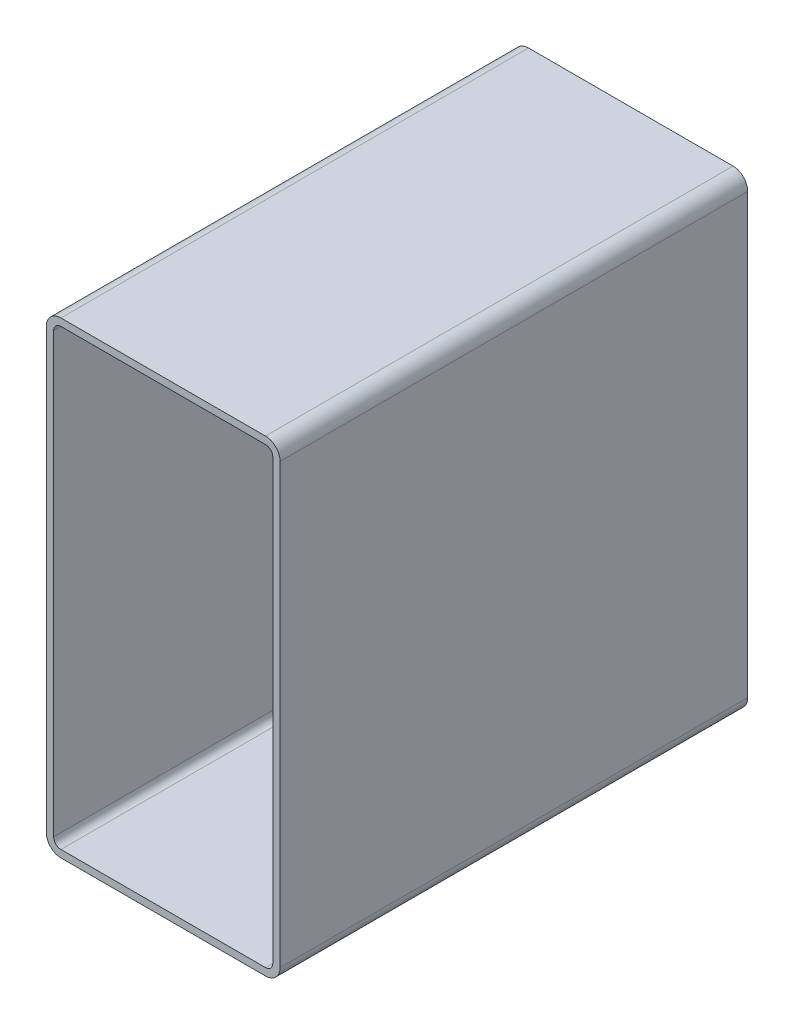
ISO-10303-21;
HEADER;
FILE_DESCRIPTION(('STEP AP214'),'2;1');
FILE_NAME('part.step','',(''),(''),'','','');
FILE_SCHEMA(('AUTOMOTIVE_DESIGN { 1 0 10303 214 1 1 1 1 }'));
ENDSEC;
DATA;
#1=APPLICATION_CONTEXT('core data for automotive mechanical design processes');
#2=APPLICATION_PROTOCOL_DEFINITION('international standard','automotive_design',2000,#1);
#3=PRODUCT_CONTEXT('',#1,'mechanical');
#4=PRODUCT('Part','Part','',(#3));
#5=PRODUCT_RELATED_PRODUCT_CATEGORY('part','',(#4));
#6=PRODUCT_DEFINITION_FORMATION('','',#4);
#7=PRODUCT_DEFINITION_CONTEXT('part definition',#1,'design');
#8=PRODUCT_DEFINITION('design','',#6,#7);
#9=PRODUCT_DEFINITION_SHAPE('','',#8);
#10=(LENGTH_UNIT() NAMED_UNIT(*) SI_UNIT(.MILLI.,.METRE.));
#11=(NAMED_UNIT(*) PLANE_ANGLE_UNIT() SI_UNIT($,.RADIAN.));
#12=(NAMED_UNIT(*) SI_UNIT($,.STERADIAN.) SOLID_ANGLE_UNIT());
#13=UNCERTAINTY_MEASURE_WITH_UNIT(LENGTH_MEASURE(1.E-05),#10,'distance_accuracy_value','');
#14=(GEOMETRIC_REPRESENTATION_CONTEXT(3) GLOBAL_UNCERTAINTY_ASSIGNED_CONTEXT((#13)) GLOBAL_UNIT_ASSIGNED_CONTEXT((#10,
#11,#12)) REPRESENTATION_CONTEXT('',''));
#15=CARTESIAN_POINT('',(0.,0.,0.));
#16=DIRECTION('',(0.,0.,1.));
#17=DIRECTION('',(1.,0.,0.));
#18=AXIS2_PLACEMENT_3D('',#15,#16,#17);
#19=CARTESIAN_POINT('',(9.57230139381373,297.149496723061,304.8));
#20=DIRECTION('',(0.,0.,1.));
#21=DIRECTION('',(1.,0.,0.));
#22=AXIS2_PLACEMENT_3D('',#19,#20,#21);
#23=PLANE('',#22);
#24=CARTESIAN_POINT('',(9.57230139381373,297.149496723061,304.8));
#25=DIRECTION('',(0.,0.,1.));
#26=DIRECTION('',(1.,0.,0.));
#27=AXIS2_PLACEMENT_3D('',#24,#25,#26);
#28=CIRCLE('',#27,9.52500000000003);
#29=CARTESIAN_POINT('',(9.57230139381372,306.674496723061,304.8));
#30=VERTEX_POINT('',#29);
#31=CARTESIAN_POINT('',(0.0473013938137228,297.149496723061,304.8));
#32=VERTEX_POINT('',#31);
#33=EDGE_CURVE('E211',#30,#32,#28,.T.);
#34=ORIENTED_EDGE('',*,*,#33,.T.);
#35=DIRECTION('',(0.,-1.,0.));
#36=VECTOR('',#35,1.);
#37=CARTESIAN_POINT('',(0.0473013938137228,11.3994967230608,304.8));
#38=LINE('',#37,#36);
#39=CARTESIAN_POINT('',(0.0473013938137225,11.3994967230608,304.8));
#40=VERTEX_POINT('',#39);
#41=EDGE_CURVE('E214',#32,#40,#38,.T.);
#42=ORIENTED_EDGE('',*,*,#41,.T.);
#43=CARTESIAN_POINT('',(9.57230139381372,11.3994967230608,304.8));
#44=DIRECTION('',(0.,0.,1.));
#45=DIRECTION('',(1.,0.,0.));
#46=AXIS2_PLACEMENT_3D('',#43,#44,#45);
#47=CIRCLE('',#46,9.525);
#48=CARTESIAN_POINT('',(9.57230139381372,1.87449672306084,304.8));
#49=VERTEX_POINT('',#48);
#50=EDGE_CURVE('E217',#40,#49,#47,.T.);
#51=ORIENTED_EDGE('',*,*,#50,.T.);
#52=DIRECTION('',(1.,0.,0.));
#53=VECTOR('',#52,1.);
#54=CARTESIAN_POINT('',(142.922301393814,1.87449672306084,304.8));
#55=LINE('',#54,#53);
#56=CARTESIAN_POINT('',(142.922301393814,1.87449672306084,304.8));
#57=VERTEX_POINT('',#56);
#58=EDGE_CURVE('E219',#49,#57,#55,.T.);
#59=ORIENTED_EDGE('',*,*,#58,.T.);
#60=CARTESIAN_POINT('',(142.922301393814,11.3994967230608,304.8));
#61=DIRECTION('',(0.,0.,1.));
#62=DIRECTION('',(1.,0.,0.));
#63=AXIS2_PLACEMENT_3D('',#60,#61,#62);
#64=CIRCLE('',#63,9.52500000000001);
#65=CARTESIAN_POINT('',(152.447301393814,11.3994967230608,304.8));
#66=VERTEX_POINT('',#65);
#67=EDGE_CURVE('E221',#57,#66,#64,.T.);
#68=ORIENTED_EDGE('',*,*,#67,.T.);
#69=DIRECTION('',(0.,1.,0.));
#70=VECTOR('',#69,1.);
#71=CARTESIAN_POINT('',(152.447301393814,297.149496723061,304.8));
#72=LINE('',#71,#70);
#73=CARTESIAN_POINT('',(152.447301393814,297.149496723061,304.8));
#74=VERTEX_POINT('',#73);
#75=EDGE_CURVE('E223',#66,#74,#72,.T.);
#76=ORIENTED_EDGE('',*,*,#75,.T.);
#77=CARTESIAN_POINT('',(142.922301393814,297.149496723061,304.8));
#78=DIRECTION('',(0.,0.,1.));
#79=DIRECTION('',(1.,0.,0.));
#80=AXIS2_PLACEMENT_3D('',#77,#78,#79);
#81=CIRCLE('',#80,9.52500000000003);
#82=CARTESIAN_POINT('',(142.922301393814,306.674496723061,304.8));
#83=VERTEX_POINT('',#82);
#84=EDGE_CURVE('E225',#74,#83,#81,.T.);
#85=ORIENTED_EDGE('',*,*,#84,.T.);
#86=DIRECTION('',(-1.,0.,0.));
#87=VECTOR('',#86,1.);
#88=CARTESIAN_POINT('',(9.57230139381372,306.674496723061,304.8));
#89=LINE('',#88,#87);
#90=EDGE_CURVE('E227',#83,#30,#89,.T.);
#91=ORIENTED_EDGE('',*,*,#90,.T.);
#92=EDGE_LOOP('',(#34,#42,#51,#59,#68,#76,#85,#91));
#93=FACE_BOUND('',#92,.T.);
#94=DIRECTION('',(0.,-1.,0.));
#95=VECTOR('',#94,1.);
#96=CARTESIAN_POINT('',(4.80980139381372,11.3994967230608,304.8));
#97=LINE('',#96,#95);
#98=CARTESIAN_POINT('',(4.80980139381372,297.149496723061,304.8));
#99=VERTEX_POINT('',#98);
#100=CARTESIAN_POINT('',(4.80980139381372,11.3994967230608,304.8));
#101=VERTEX_POINT('',#100);
#102=EDGE_CURVE('E154',#99,#101,#97,.T.);
#103=ORIENTED_EDGE('',*,*,#102,.F.);
#104=CARTESIAN_POINT('',(9.57230139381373,297.149496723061,304.8));
#105=DIRECTION('',(0.,0.,1.));
#106=DIRECTION('',(1.,0.,0.));
#107=AXIS2_PLACEMENT_3D('',#104,#105,#106);
#108=CIRCLE('',#107,4.7625);
#109=CARTESIAN_POINT('',(9.57230139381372,301.911996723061,304.8));
#110=VERTEX_POINT('',#109);
#111=EDGE_CURVE('E146',#110,#99,#108,.T.);
#112=ORIENTED_EDGE('',*,*,#111,.F.);
#113=DIRECTION('',(-1.,0.,0.));
#114=VECTOR('',#113,1.);
#115=CARTESIAN_POINT('',(9.57230139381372,301.911996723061,304.8));
#116=LINE('',#115,#114);
#117=CARTESIAN_POINT('',(142.922301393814,301.911996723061,304.8));
#118=VERTEX_POINT('',#117);
#119=EDGE_CURVE('E179',#118,#110,#116,.T.);
#120=ORIENTED_EDGE('',*,*,#119,.F.);
#121=CARTESIAN_POINT('',(142.922301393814,297.149496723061,304.8));
#122=DIRECTION('',(0.,0.,1.));
#123=DIRECTION('',(1.,0.,0.));
#124=AXIS2_PLACEMENT_3D('',#121,#122,#123);
#125=CIRCLE('',#124,4.7625);
#126=CARTESIAN_POINT('',(147.684801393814,297.149496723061,304.8));
#127=VERTEX_POINT('',#126);
#128=EDGE_CURVE('E177',#127,#118,#125,.T.);
#129=ORIENTED_EDGE('',*,*,#128,.F.);
#130=DIRECTION('',(0.,1.,0.));
#131=VECTOR('',#130,1.);
#132=CARTESIAN_POINT('',(147.684801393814,297.149496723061,304.8));
#133=LINE('',#132,#131);
#134=CARTESIAN_POINT('',(147.684801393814,11.3994967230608,304.8));
#135=VERTEX_POINT('',#134);
#136=EDGE_CURVE('E175',#135,#127,#133,.T.);
#137=ORIENTED_EDGE('',*,*,#136,.F.);
#138=CARTESIAN_POINT('',(142.922301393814,11.3994967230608,304.8));
#139=DIRECTION('',(0.,0.,1.));
#140=DIRECTION('',(1.,0.,0.));
#141=AXIS2_PLACEMENT_3D('',#138,#139,#140);
#142=CIRCLE('',#141,4.7625);
#143=CARTESIAN_POINT('',(142.922301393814,6.63699672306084,304.8));
#144=VERTEX_POINT('',#143);
#145=EDGE_CURVE('E173',#144,#135,#142,.T.);
#146=ORIENTED_EDGE('',*,*,#145,.F.);
#147=DIRECTION('',(1.,0.,0.));
#148=VECTOR('',#147,1.);
#149=CARTESIAN_POINT('',(142.922301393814,6.63699672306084,304.8));
#150=LINE('',#149,#148);
#151=CARTESIAN_POINT('',(9.57230139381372,6.63699672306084,304.8));
#152=VERTEX_POINT('',#151);
#153=EDGE_CURVE('E169',#152,#144,#150,.T.);
#154=ORIENTED_EDGE('',*,*,#153,.F.);
#155=CARTESIAN_POINT('',(9.57230139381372,11.3994967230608,304.8));
#156=DIRECTION('',(0.,0.,1.));
#157=DIRECTION('',(1.,0.,0.));
#158=AXIS2_PLACEMENT_3D('',#155,#156,#157);
#159=CIRCLE('',#158,4.7625);
#160=EDGE_CURVE('E167',#101,#152,#159,.T.);
#161=ORIENTED_EDGE('',*,*,#160,.F.);
#162=EDGE_LOOP('',(#103,#112,#120,#129,#137,#146,#154,#161));
#163=FACE_BOUND('',#162,.T.);
#164=ADVANCED_FACE('F33',(#93,#163),#23,.T.);
#165=CARTESIAN_POINT('',(9.57230139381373,297.149496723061,0.));
#166=DIRECTION('',(0.,0.,1.));
#167=DIRECTION('',(1.,0.,0.));
#168=AXIS2_PLACEMENT_3D('',#165,#166,#167);
#169=PLANE('',#168);
#170=CARTESIAN_POINT('',(9.57230139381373,297.149496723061,0.));
#171=DIRECTION('',(0.,0.,1.));
#172=DIRECTION('',(1.,0.,0.));
#173=AXIS2_PLACEMENT_3D('',#170,#171,#172);
#174=CIRCLE('',#173,9.52500000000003);
#175=CARTESIAN_POINT('',(9.57230139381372,306.674496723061,0.));
#176=VERTEX_POINT('',#175);
#177=CARTESIAN_POINT('',(0.0473013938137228,297.149496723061,0.));
#178=VERTEX_POINT('',#177);
#179=EDGE_CURVE('E162',#176,#178,#174,.T.);
#180=ORIENTED_EDGE('',*,*,#179,.F.);
#181=DIRECTION('',(-1.,0.,0.));
#182=VECTOR('',#181,1.);
#183=CARTESIAN_POINT('',(9.57230139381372,306.674496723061,0.));
#184=LINE('',#183,#182);
#185=CARTESIAN_POINT('',(142.922301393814,306.674496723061,0.));
#186=VERTEX_POINT('',#185);
#187=EDGE_CURVE('E215',#186,#176,#184,.T.);
#188=ORIENTED_EDGE('',*,*,#187,.F.);
#189=CARTESIAN_POINT('',(142.922301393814,297.149496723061,0.));
#190=DIRECTION('',(0.,0.,1.));
#191=DIRECTION('',(1.,0.,0.));
#192=AXIS2_PLACEMENT_3D('',#189,#190,#191);
#193=CIRCLE('',#192,9.52500000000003);
#194=CARTESIAN_POINT('',(152.447301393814,297.149496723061,0.));
#195=VERTEX_POINT('',#194);
#196=EDGE_CURVE('E242',#195,#186,#193,.T.);
#197=ORIENTED_EDGE('',*,*,#196,.F.);
#198=DIRECTION('',(0.,1.,0.));
#199=VECTOR('',#198,1.);
#200=CARTESIAN_POINT('',(152.447301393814,297.149496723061,0.));
#201=LINE('',#200,#199);
#202=CARTESIAN_POINT('',(152.447301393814,11.3994967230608,0.));
#203=VERTEX_POINT('',#202);
#204=EDGE_CURVE('E240',#203,#195,#201,.T.);
#205=ORIENTED_EDGE('',*,*,#204,.F.);
#206=CARTESIAN_POINT('',(142.922301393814,11.3994967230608,0.));
#207=DIRECTION('',(0.,0.,1.));
#208=DIRECTION('',(1.,0.,0.));
#209=AXIS2_PLACEMENT_3D('',#206,#207,#208);
#210=CIRCLE('',#209,9.52500000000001);
#211=CARTESIAN_POINT('',(142.922301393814,1.87449672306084,0.));
#212=VERTEX_POINT('',#211);
#213=EDGE_CURVE('E238',#212,#203,#210,.T.);
#214=ORIENTED_EDGE('',*,*,#213,.F.);
#215=DIRECTION('',(1.,0.,0.));
#216=VECTOR('',#215,1.);
#217=CARTESIAN_POINT('',(142.922301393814,1.87449672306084,0.));
#218=LINE('',#217,#216);
#219=CARTESIAN_POINT('',(9.57230139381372,1.87449672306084,0.));
#220=VERTEX_POINT('',#219);
#221=EDGE_CURVE('E236',#220,#212,#218,.T.);
#222=ORIENTED_EDGE('',*,*,#221,.F.);
#223=CARTESIAN_POINT('',(9.57230139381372,11.3994967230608,0.));
#224=DIRECTION('',(0.,0.,1.));
#225=DIRECTION('',(1.,0.,0.));
#226=AXIS2_PLACEMENT_3D('',#223,#224,#225);
#227=CIRCLE('',#226,9.525);
#228=CARTESIAN_POINT('',(0.0473013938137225,11.3994967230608,0.));
#229=VERTEX_POINT('',#228);
#230=EDGE_CURVE('E234',#229,#220,#227,.T.);
#231=ORIENTED_EDGE('',*,*,#230,.F.);
#232=DIRECTION('',(0.,-1.,0.));
#233=VECTOR('',#232,1.);
#234=CARTESIAN_POINT('',(0.0473013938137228,11.3994967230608,0.));
#235=LINE('',#234,#233);
#236=EDGE_CURVE('E232',#178,#229,#235,.T.);
#237=ORIENTED_EDGE('',*,*,#236,.F.);
#238=EDGE_LOOP('',(#180,#188,#197,#205,#214,#222,#231,#237));
#239=FACE_BOUND('',#238,.T.);
#240=CARTESIAN_POINT('',(9.57230139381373,297.149496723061,0.));
#241=DIRECTION('',(0.,0.,1.));
#242=DIRECTION('',(1.,0.,0.));
#243=AXIS2_PLACEMENT_3D('',#240,#241,#242);
#244=CIRCLE('',#243,4.7625);
#245=CARTESIAN_POINT('',(9.57230139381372,301.911996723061,0.));
#246=VERTEX_POINT('',#245);
#247=CARTESIAN_POINT('',(4.80980139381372,297.149496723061,0.));
#248=VERTEX_POINT('',#247);
#249=EDGE_CURVE('E56',#246,#248,#244,.T.);
#250=ORIENTED_EDGE('',*,*,#249,.T.);
#251=DIRECTION('',(0.,-1.,0.));
#252=VECTOR('',#251,1.);
#253=CARTESIAN_POINT('',(4.80980139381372,11.3994967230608,0.));
#254=LINE('',#253,#252);
#255=CARTESIAN_POINT('',(4.80980139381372,11.3994967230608,0.));
#256=VERTEX_POINT('',#255);
#257=EDGE_CURVE('E161',#248,#256,#254,.T.);
#258=ORIENTED_EDGE('',*,*,#257,.T.);
#259=CARTESIAN_POINT('',(9.57230139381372,11.3994967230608,0.));
#260=DIRECTION('',(0.,0.,1.));
#261=DIRECTION('',(1.,0.,0.));
#262=AXIS2_PLACEMENT_3D('',#259,#260,#261);
#263=CIRCLE('',#262,4.7625);
#264=CARTESIAN_POINT('',(9.57230139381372,6.63699672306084,0.));
#265=VERTEX_POINT('',#264);
#266=EDGE_CURVE('E183',#256,#265,#263,.T.);
#267=ORIENTED_EDGE('',*,*,#266,.T.);
#268=DIRECTION('',(1.,0.,0.));
#269=VECTOR('',#268,1.);
#270=CARTESIAN_POINT('',(142.922301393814,6.63699672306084,0.));
#271=LINE('',#270,#269);
#272=CARTESIAN_POINT('',(142.922301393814,6.63699672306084,0.));
#273=VERTEX_POINT('',#272);
#274=EDGE_CURVE('E186',#265,#273,#271,.T.);
#275=ORIENTED_EDGE('',*,*,#274,.T.);
#276=CARTESIAN_POINT('',(142.922301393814,11.3994967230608,0.));
#277=DIRECTION('',(0.,0.,1.));
#278=DIRECTION('',(1.,0.,0.));
#279=AXIS2_PLACEMENT_3D('',#276,#277,#278);
#280=CIRCLE('',#279,4.7625);
#281=CARTESIAN_POINT('',(147.684801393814,11.3994967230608,0.));
#282=VERTEX_POINT('',#281);
#283=EDGE_CURVE('E189',#273,#282,#280,.T.);
#284=ORIENTED_EDGE('',*,*,#283,.T.);
#285=DIRECTION('',(0.,1.,0.));
#286=VECTOR('',#285,1.);
#287=CARTESIAN_POINT('',(147.684801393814,297.149496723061,0.));
#288=LINE('',#287,#286);
#289=CARTESIAN_POINT('',(147.684801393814,297.149496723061,0.));
#290=VERTEX_POINT('',#289);
#291=EDGE_CURVE('E192',#282,#290,#288,.T.);
#292=ORIENTED_EDGE('',*,*,#291,.T.);
#293=CARTESIAN_POINT('',(142.922301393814,297.149496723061,0.));
#294=DIRECTION('',(0.,0.,1.));
#295=DIRECTION('',(1.,0.,0.));
#296=AXIS2_PLACEMENT_3D('',#293,#294,#295);
#297=CIRCLE('',#296,4.7625);
#298=CARTESIAN_POINT('',(142.922301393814,301.911996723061,0.));
#299=VERTEX_POINT('',#298);
#300=EDGE_CURVE('E195',#290,#299,#297,.T.);
#301=ORIENTED_EDGE('',*,*,#300,.T.);
#302=DIRECTION('',(-1.,0.,0.));
#303=VECTOR('',#302,1.);
#304=CARTESIAN_POINT('',(9.57230139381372,301.911996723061,0.));
#305=LINE('',#304,#303);
#306=EDGE_CURVE('E155',#299,#246,#305,.T.);
#307=ORIENTED_EDGE('',*,*,#306,.T.);
#308=EDGE_LOOP('',(#250,#258,#267,#275,#284,#292,#301,#307));
#309=FACE_BOUND('',#308,.T.);
#310=ADVANCED_FACE('F272',(#239,#309),#169,.F.);
#311=CARTESIAN_POINT('',(9.57230139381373,297.149496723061,304.8));
#312=DIRECTION('',(0.,0.,-1.));
#313=DIRECTION('',(-1.,0.,0.));
#314=AXIS2_PLACEMENT_3D('',#311,#312,#313);
#315=CYLINDRICAL_SURFACE('',#314,9.52500000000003);
#316=ORIENTED_EDGE('',*,*,#179,.T.);
#317=DIRECTION('',(0.,0.,-1.));
#318=VECTOR('',#317,1.);
#319=CARTESIAN_POINT('',(0.0473013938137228,297.149496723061,304.8));
#320=LINE('',#319,#318);
#321=EDGE_CURVE('E11',#32,#178,#320,.T.);
#322=ORIENTED_EDGE('',*,*,#321,.F.);
#323=ORIENTED_EDGE('',*,*,#33,.F.);
#324=DIRECTION('',(0.,0.,-1.));
#325=VECTOR('',#324,1.);
#326=CARTESIAN_POINT('',(9.57230139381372,306.674496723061,304.8));
#327=LINE('',#326,#325);
#328=EDGE_CURVE('E229',#30,#176,#327,.T.);
#329=ORIENTED_EDGE('',*,*,#328,.T.);
#330=EDGE_LOOP('',(#316,#322,#323,#329));
#331=FACE_BOUND('',#330,.T.);
#332=ADVANCED_FACE('F35',(#331),#315,.T.);
#333=CARTESIAN_POINT('',(0.0473013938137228,11.3994967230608,304.8));
#334=DIRECTION('',(1.,0.,0.));
#335=DIRECTION('',(0.,0.,-1.));
#336=AXIS2_PLACEMENT_3D('',#333,#334,#335);
#337=PLANE('',#336);
#338=ORIENTED_EDGE('',*,*,#236,.T.);
#339=DIRECTION('',(0.,0.,-1.));
#340=VECTOR('',#339,1.);
#341=CARTESIAN_POINT('',(0.0473013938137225,11.3994967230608,304.8));
#342=LINE('',#341,#340);
#343=EDGE_CURVE('E41',#40,#229,#342,.T.);
#344=ORIENTED_EDGE('',*,*,#343,.F.);
#345=ORIENTED_EDGE('',*,*,#41,.F.);
#346=ORIENTED_EDGE('',*,*,#321,.T.);
#347=EDGE_LOOP('',(#338,#344,#345,#346));
#348=FACE_BOUND('',#347,.T.);
#349=ADVANCED_FACE('F289',(#348),#337,.F.);
#350=CARTESIAN_POINT('',(9.57230139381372,11.3994967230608,304.8));
#351=DIRECTION('',(0.,0.,-1.));
#352=DIRECTION('',(-1.,0.,0.));
#353=AXIS2_PLACEMENT_3D('',#350,#351,#352);
#354=CYLINDRICAL_SURFACE('',#353,9.525);
#355=ORIENTED_EDGE('',*,*,#230,.T.);
#356=DIRECTION('',(0.,0.,-1.));
#357=VECTOR('',#356,1.);
#358=CARTESIAN_POINT('',(9.57230139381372,1.87449672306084,304.8));
#359=LINE('',#358,#357);
#360=EDGE_CURVE('E259',#49,#220,#359,.T.);
#361=ORIENTED_EDGE('',*,*,#360,.F.);
#362=ORIENTED_EDGE('',*,*,#50,.F.);
#363=ORIENTED_EDGE('',*,*,#343,.T.);
#364=EDGE_LOOP('',(#355,#361,#362,#363));
#365=FACE_BOUND('',#364,.T.);
#366=ADVANCED_FACE('F266',(#365),#354,.T.);
#367=CARTESIAN_POINT('',(142.922301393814,1.87449672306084,304.8));
#368=DIRECTION('',(0.,1.,0.));
#369=DIRECTION('',(0.,0.,1.));
#370=AXIS2_PLACEMENT_3D('',#367,#368,#369);
#371=PLANE('',#370);
#372=ORIENTED_EDGE('',*,*,#221,.T.);
#373=DIRECTION('',(0.,0.,-1.));
#374=VECTOR('',#373,1.);
#375=CARTESIAN_POINT('',(142.922301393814,1.87449672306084,304.8));
#376=LINE('',#375,#374);
#377=EDGE_CURVE('E256',#57,#212,#376,.T.);
#378=ORIENTED_EDGE('',*,*,#377,.F.);
#379=ORIENTED_EDGE('',*,*,#58,.F.);
#380=ORIENTED_EDGE('',*,*,#360,.T.);
#381=EDGE_LOOP('',(#372,#378,#379,#380));
#382=FACE_BOUND('',#381,.T.);
#383=ADVANCED_FACE('F278',(#382),#371,.F.);
#384=CARTESIAN_POINT('',(142.922301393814,11.3994967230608,304.8));
#385=DIRECTION('',(0.,0.,-1.));
#386=DIRECTION('',(-1.,0.,0.));
#387=AXIS2_PLACEMENT_3D('',#384,#385,#386);
#388=CYLINDRICAL_SURFACE('',#387,9.52500000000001);
#389=ORIENTED_EDGE('',*,*,#213,.T.);
#390=DIRECTION('',(0.,0.,-1.));
#391=VECTOR('',#390,1.);
#392=CARTESIAN_POINT('',(152.447301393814,11.3994967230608,304.8));
#393=LINE('',#392,#391);
#394=EDGE_CURVE('E253',#66,#203,#393,.T.);
#395=ORIENTED_EDGE('',*,*,#394,.F.);
#396=ORIENTED_EDGE('',*,*,#67,.F.);
#397=ORIENTED_EDGE('',*,*,#377,.T.);
#398=EDGE_LOOP('',(#389,#395,#396,#397));
#399=FACE_BOUND('',#398,.T.);
#400=ADVANCED_FACE('F282',(#399),#388,.T.);
#401=CARTESIAN_POINT('',(152.447301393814,297.149496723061,304.8));
#402=DIRECTION('',(-1.,0.,0.));
#403=DIRECTION('',(0.,0.,1.));
#404=AXIS2_PLACEMENT_3D('',#401,#402,#403);
#405=PLANE('',#404);
#406=ORIENTED_EDGE('',*,*,#204,.T.);
#407=DIRECTION('',(0.,0.,-1.));
#408=VECTOR('',#407,1.);
#409=CARTESIAN_POINT('',(152.447301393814,297.149496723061,304.8));
#410=LINE('',#409,#408);
#411=EDGE_CURVE('E250',#74,#195,#410,.T.);
#412=ORIENTED_EDGE('',*,*,#411,.F.);
#413=ORIENTED_EDGE('',*,*,#75,.F.);
#414=ORIENTED_EDGE('',*,*,#394,.T.);
#415=EDGE_LOOP('',(#406,#412,#413,#414));
#416=FACE_BOUND('',#415,.T.);
#417=ADVANCED_FACE('F302',(#416),#405,.F.);
#418=CARTESIAN_POINT('',(142.922301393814,297.149496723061,304.8));
#419=DIRECTION('',(0.,0.,-1.));
#420=DIRECTION('',(-1.,0.,0.));
#421=AXIS2_PLACEMENT_3D('',#418,#419,#420);
#422=CYLINDRICAL_SURFACE('',#421,9.52500000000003);
#423=ORIENTED_EDGE('',*,*,#196,.T.);
#424=DIRECTION('',(0.,0.,-1.));
#425=VECTOR('',#424,1.);
#426=CARTESIAN_POINT('',(142.922301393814,306.674496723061,304.8));
#427=LINE('',#426,#425);
#428=EDGE_CURVE('E247',#83,#186,#427,.T.);
#429=ORIENTED_EDGE('',*,*,#428,.F.);
#430=ORIENTED_EDGE('',*,*,#84,.F.);
#431=ORIENTED_EDGE('',*,*,#411,.T.);
#432=EDGE_LOOP('',(#423,#429,#430,#431));
#433=FACE_BOUND('',#432,.T.);
#434=ADVANCED_FACE('F300',(#433),#422,.T.);
#435=CARTESIAN_POINT('',(9.57230139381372,306.674496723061,304.8));
#436=DIRECTION('',(0.,-1.,0.));
#437=DIRECTION('',(0.,0.,-1.));
#438=AXIS2_PLACEMENT_3D('',#435,#436,#437);
#439=PLANE('',#438);
#440=ORIENTED_EDGE('',*,*,#187,.T.);
#441=ORIENTED_EDGE('',*,*,#328,.F.);
#442=ORIENTED_EDGE('',*,*,#90,.F.);
#443=ORIENTED_EDGE('',*,*,#428,.T.);
#444=EDGE_LOOP('',(#440,#441,#442,#443));
#445=FACE_BOUND('',#444,.T.);
#446=ADVANCED_FACE('F295',(#445),#439,.F.);
#447=CARTESIAN_POINT('',(9.57230139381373,297.149496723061,304.8));
#448=DIRECTION('',(0.,0.,-1.));
#449=DIRECTION('',(-1.,0.,0.));
#450=AXIS2_PLACEMENT_3D('',#447,#448,#449);
#451=CYLINDRICAL_SURFACE('',#450,4.7625);
#452=ORIENTED_EDGE('',*,*,#249,.F.);
#453=DIRECTION('',(0.,0.,-1.));
#454=VECTOR('',#453,1.);
#455=CARTESIAN_POINT('',(9.57230139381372,301.911996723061,304.8));
#456=LINE('',#455,#454);
#457=EDGE_CURVE('E150',#110,#246,#456,.T.);
#458=ORIENTED_EDGE('',*,*,#457,.F.);
#459=ORIENTED_EDGE('',*,*,#111,.T.);
#460=DIRECTION('',(0.,0.,-1.));
#461=VECTOR('',#460,1.);
#462=CARTESIAN_POINT('',(4.80980139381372,297.149496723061,304.8));
#463=LINE('',#462,#461);
#464=EDGE_CURVE('E149',#99,#248,#463,.T.);
#465=ORIENTED_EDGE('',*,*,#464,.T.);
#466=EDGE_LOOP('',(#452,#458,#459,#465));
#467=FACE_BOUND('',#466,.T.);
#468=ADVANCED_FACE('F148',(#467),#451,.F.);
#469=CARTESIAN_POINT('',(4.80980139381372,11.3994967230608,304.8));
#470=DIRECTION('',(1.,0.,0.));
#471=DIRECTION('',(0.,0.,-1.));
#472=AXIS2_PLACEMENT_3D('',#469,#470,#471);
#473=PLANE('',#472);
#474=ORIENTED_EDGE('',*,*,#257,.F.);
#475=ORIENTED_EDGE('',*,*,#464,.F.);
#476=ORIENTED_EDGE('',*,*,#102,.T.);
#477=DIRECTION('',(0.,0.,-1.));
#478=VECTOR('',#477,1.);
#479=CARTESIAN_POINT('',(4.80980139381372,11.3994967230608,304.8));
#480=LINE('',#479,#478);
#481=EDGE_CURVE('E163',#101,#256,#480,.T.);
#482=ORIENTED_EDGE('',*,*,#481,.T.);
#483=EDGE_LOOP('',(#474,#475,#476,#482));
#484=FACE_BOUND('',#483,.T.);
#485=ADVANCED_FACE('F158',(#484),#473,.T.);
#486=CARTESIAN_POINT('',(9.57230139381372,11.3994967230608,304.8));
#487=DIRECTION('',(0.,0.,-1.));
#488=DIRECTION('',(-1.,0.,0.));
#489=AXIS2_PLACEMENT_3D('',#486,#487,#488);
#490=CYLINDRICAL_SURFACE('',#489,4.7625);
#491=ORIENTED_EDGE('',*,*,#266,.F.);
#492=ORIENTED_EDGE('',*,*,#481,.F.);
#493=ORIENTED_EDGE('',*,*,#160,.T.);
#494=DIRECTION('',(0.,0.,-1.));
#495=VECTOR('',#494,1.);
#496=CARTESIAN_POINT('',(9.57230139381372,6.63699672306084,304.8));
#497=LINE('',#496,#495);
#498=EDGE_CURVE('E208',#152,#265,#497,.T.);
#499=ORIENTED_EDGE('',*,*,#498,.T.);
#500=EDGE_LOOP('',(#491,#492,#493,#499));
#501=FACE_BOUND('',#500,.T.);
#502=ADVANCED_FACE('F327',(#501),#490,.F.);
#503=CARTESIAN_POINT('',(142.922301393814,6.63699672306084,304.8));
#504=DIRECTION('',(0.,1.,0.));
#505=DIRECTION('',(0.,0.,1.));
#506=AXIS2_PLACEMENT_3D('',#503,#504,#505);
#507=PLANE('',#506);
#508=ORIENTED_EDGE('',*,*,#274,.F.);
#509=ORIENTED_EDGE('',*,*,#498,.F.);
#510=ORIENTED_EDGE('',*,*,#153,.T.);
#511=DIRECTION('',(0.,0.,-1.));
#512=VECTOR('',#511,1.);
#513=CARTESIAN_POINT('',(142.922301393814,6.63699672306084,304.8));
#514=LINE('',#513,#512);
#515=EDGE_CURVE('E206',#144,#273,#514,.T.);
#516=ORIENTED_EDGE('',*,*,#515,.T.);
#517=EDGE_LOOP('',(#508,#509,#510,#516));
#518=FACE_BOUND('',#517,.T.);
#519=ADVANCED_FACE('F331',(#518),#507,.T.);
#520=CARTESIAN_POINT('',(142.922301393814,11.3994967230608,304.8));
#521=DIRECTION('',(0.,0.,-1.));
#522=DIRECTION('',(-1.,0.,0.));
#523=AXIS2_PLACEMENT_3D('',#520,#521,#522);
#524=CYLINDRICAL_SURFACE('',#523,4.7625);
#525=ORIENTED_EDGE('',*,*,#283,.F.);
#526=ORIENTED_EDGE('',*,*,#515,.F.);
#527=ORIENTED_EDGE('',*,*,#145,.T.);
#528=DIRECTION('',(0.,0.,-1.));
#529=VECTOR('',#528,1.);
#530=CARTESIAN_POINT('',(147.684801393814,11.3994967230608,304.8));
#531=LINE('',#530,#529);
#532=EDGE_CURVE('E204',#135,#282,#531,.T.);
#533=ORIENTED_EDGE('',*,*,#532,.T.);
#534=EDGE_LOOP('',(#525,#526,#527,#533));
#535=FACE_BOUND('',#534,.T.);
#536=ADVANCED_FACE('F337',(#535),#524,.F.);
#537=CARTESIAN_POINT('',(147.684801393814,297.149496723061,304.8));
#538=DIRECTION('',(-1.,0.,0.));
#539=DIRECTION('',(0.,0.,1.));
#540=AXIS2_PLACEMENT_3D('',#537,#538,#539);
#541=PLANE('',#540);
#542=ORIENTED_EDGE('',*,*,#291,.F.);
#543=ORIENTED_EDGE('',*,*,#532,.F.);
#544=ORIENTED_EDGE('',*,*,#136,.T.);
#545=DIRECTION('',(0.,0.,-1.));
#546=VECTOR('',#545,1.);
#547=CARTESIAN_POINT('',(147.684801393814,297.149496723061,304.8));
#548=LINE('',#547,#546);
#549=EDGE_CURVE('E202',#127,#290,#548,.T.);
#550=ORIENTED_EDGE('',*,*,#549,.T.);
#551=EDGE_LOOP('',(#542,#543,#544,#550));
#552=FACE_BOUND('',#551,.T.);
#553=ADVANCED_FACE('F341',(#552),#541,.T.);
#554=CARTESIAN_POINT('',(142.922301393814,297.149496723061,304.8));
#555=DIRECTION('',(0.,0.,-1.));
#556=DIRECTION('',(-1.,0.,0.));
#557=AXIS2_PLACEMENT_3D('',#554,#555,#556);
#558=CYLINDRICAL_SURFACE('',#557,4.7625);
#559=ORIENTED_EDGE('',*,*,#300,.F.);
#560=ORIENTED_EDGE('',*,*,#549,.F.);
#561=ORIENTED_EDGE('',*,*,#128,.T.);
#562=DIRECTION('',(0.,0.,-1.));
#563=VECTOR('',#562,1.);
#564=CARTESIAN_POINT('',(142.922301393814,301.911996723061,304.8));
#565=LINE('',#564,#563);
#566=EDGE_CURVE('E48',#118,#299,#565,.T.);
#567=ORIENTED_EDGE('',*,*,#566,.T.);
#568=EDGE_LOOP('',(#559,#560,#561,#567));
#569=FACE_BOUND('',#568,.T.);
#570=ADVANCED_FACE('F345',(#569),#558,.F.);
#571=CARTESIAN_POINT('',(9.57230139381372,301.911996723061,304.8));
#572=DIRECTION('',(0.,-1.,0.));
#573=DIRECTION('',(0.,0.,-1.));
#574=AXIS2_PLACEMENT_3D('',#571,#572,#573);
#575=PLANE('',#574);
#576=ORIENTED_EDGE('',*,*,#306,.F.);
#577=ORIENTED_EDGE('',*,*,#566,.F.);
#578=ORIENTED_EDGE('',*,*,#119,.T.);
#579=ORIENTED_EDGE('',*,*,#457,.T.);
#580=EDGE_LOOP('',(#576,#577,#578,#579));
#581=FACE_BOUND('',#580,.T.);
#582=ADVANCED_FACE('F349',(#581),#575,.T.);
#583=CLOSED_SHELL('',(#164,#310,#332,#349,#366,#383,#400,#417,#434,#446,#468,#485,#502,#519,
#536,#553,#570,#582));
#584=MANIFOLD_SOLID_BREP('B2',#583);
#585=ADVANCED_BREP_SHAPE_REPRESENTATION('',(#18,#584),#14);
#586=SHAPE_DEFINITION_REPRESENTATION(#9,#585);
ENDSEC;
END-ISO-10303-21;
